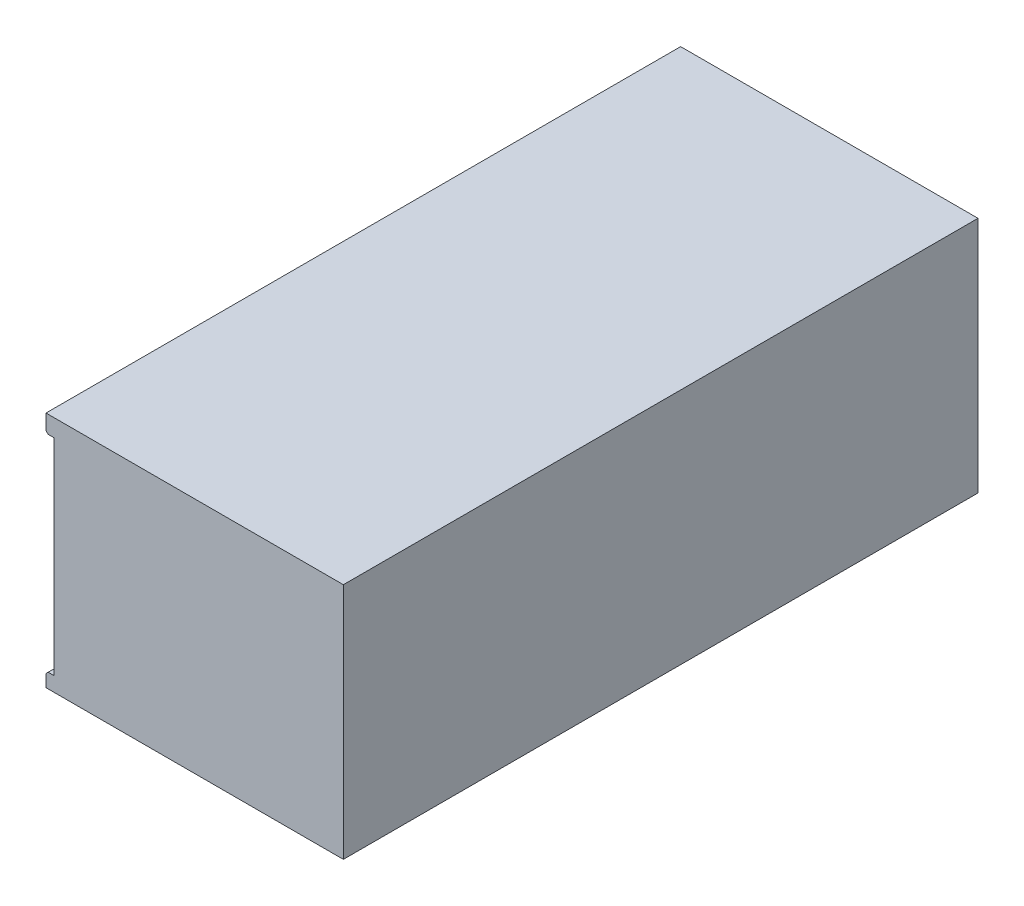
from build123d import *

# Parameters (mm, degrees)
EXTRUDE1_DEPTH                   = 55.5625
F_10_32_TAPPED_HOLE1_D           = 4.0386
F_10_32_TAPPED_HOLE1_DEPTH       = 9.99744
F_10_32_TAPPED_HOLE1_CBORE_D     = 4.826
F_10_32_TAPPED_HOLE1_CBORE_DEPTH = 7.62
F_10_32_TAPPED_HOLE1_TIP         = 1.213317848
CHAMFER1_SIZE                    = 0.381


with BuildPart() as part:
    # Sketch1 → Extrude1 (new, symmetric)
    with BuildSketch(Plane.XY):
        Polygon((50.673, 0), (50.673, -41.656), (-1.397, -41.656), (-1.397, -39.116), (0, -39.116), (0, -3.048), (-1.397, -3.048), (-1.397, 0), align=None)
    extrude(amount=EXTRUDE1_DEPTH, both=True)

    # 10-32 Tapped Hole1
    with Locations(Plane(origin=(0, -6.35, -50.2666), x_dir=(0, 0, -1), z_dir=(-1, 0, 0))):
        with Locations((0, 0), (-100.5332, 0), (-55.1434, 0), (-45.3898, 0), (0, 29.464), (-45.3898, 29.464), (-55.1434, 29.464), (-100.5332, 29.464)):
            CounterBoreHole(F_10_32_TAPPED_HOLE1_D / 2, F_10_32_TAPPED_HOLE1_CBORE_D / 2, F_10_32_TAPPED_HOLE1_CBORE_DEPTH, depth=F_10_32_TAPPED_HOLE1_DEPTH)
            with Locations((0, 0, -(F_10_32_TAPPED_HOLE1_DEPTH + F_10_32_TAPPED_HOLE1_TIP / 2))):  # 118° drill point
                Cone(0, F_10_32_TAPPED_HOLE1_D / 2, F_10_32_TAPPED_HOLE1_TIP, mode=Mode.SUBTRACT)

    # Chamfer1
    chamfer1_edges = [part.edges().sort_by_distance(p)[0] for p in [
        (-1.397, -39.116, 0),
        (-1.397, -3.048, 0),
    ]]
    chamfer(chamfer1_edges, length=CHAMFER1_SIZE)


solid = part.part
